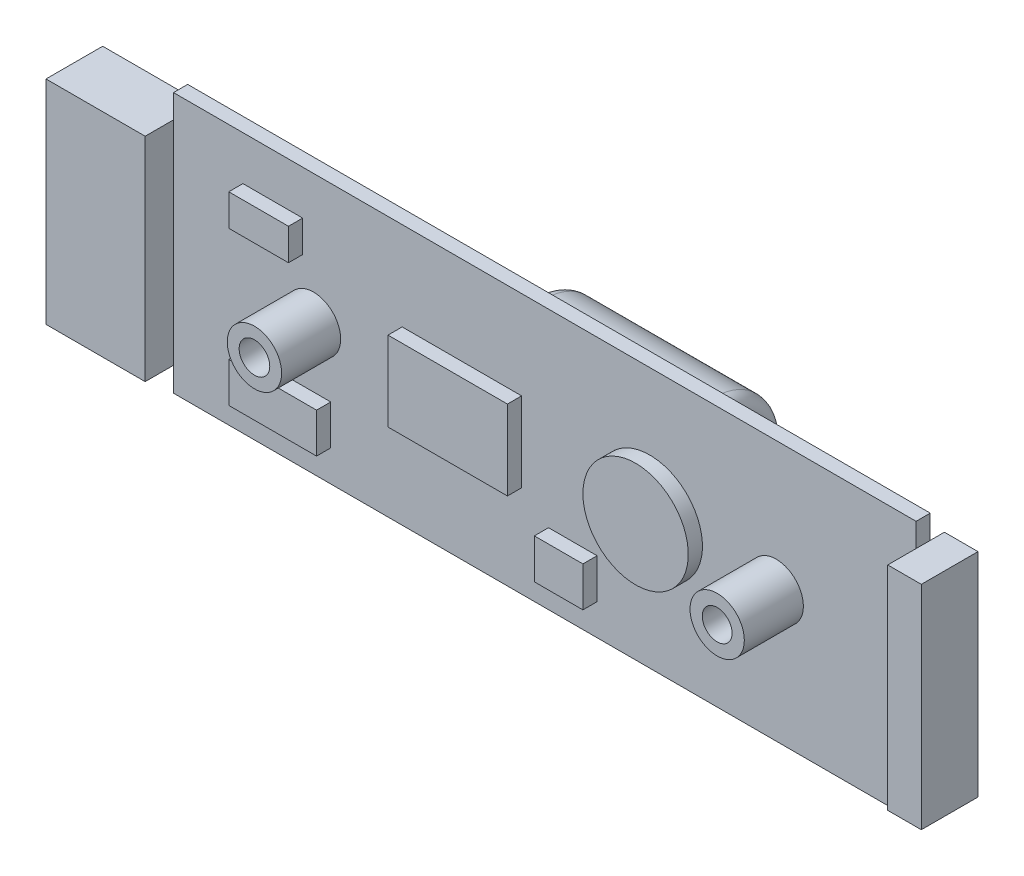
from build123d import *

# Parameters (mm, degrees)
SKETCH1_R           = 2.921
EXTRUDE3_DEPTH      = 6.35
EXTRUDE3_2_DEPTH    = 6.35
EXTRUDE4_START      = -1.524
SKETCH1_5_W         = 79.8576
SKETCH1_5_H         = 28
SKETCH1_5_R         = 2.921
EXTRUDE4_DEPTH      = 1.524
EXTRUDE5_DEPTH      = 3.048
EXTRUDE5_DEPTH_BACK = 3.048
SKETCH1_6_W         = 10.664080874
SKETCH1_6_H         = 22.86
EXTRUDE6_DEPTH      = 3.048
EXTRUDE6_DEPTH_BACK = 3.048
SKETCH1_7_W         = 3.611238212
SKETCH1_7_H         = 22.86
SKETCH4_R           = 2.989225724
SKETCH4_R_2         = 2.921
EXTRUDE7_DEPTH      = 2.032
FILLET1_R           = 1.27
FILLET2_R           = 1.27
SKETCH5_R           = 6.36772322
EXTRUDE8_DEPTH      = 20.828
FILLET3_R           = 1.27
FILLET4_R           = 1.27
SKETCH8_W           = 7.051771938
SKETCH8_H           = 4.911055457
SKETCH8_W_2         = 5.918451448
SKETCH8_H_2         = 5.162904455
SKETCH8_W_3         = 7.681394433
SKETCH8_H_3         = 3.525885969
SKETCH8_W_4         = 6.170300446
SKETCH8_H_4         = 4.155508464
EXTRUDE9_DEPTH      = 1.524
SKETCH9_R           = 5.666679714
SKETCH9_W           = 12.844298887
SKETCH9_H           = 8.562865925
SKETCH9_W_2         = 6.422149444
SKETCH9_H_2         = 3.399884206
SKETCH9_W_3         = 5.219653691
SKETCH9_H_3         = 4.281432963
SKETCH9_W_4         = 9.444337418
EXTRUDE10_DEPTH     = 1.524
SKETCH10_R          = 1.646766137
SKETCH10_R_2        = 1.604056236
CUT_EXTRUDE2_DEPTH  = 6.35
SKETCH12_W          = 4.495310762
SKETCH12_H          = 20.696232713
CUT_EXTRUDE3_DEPTH  = 7.62


with BuildPart() as part:
    # Sketch1 → Extrude3 (new body)
    with BuildSketch(Plane.XY):
        with Locations((-36.162959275, 27.336795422)):
            Circle(SKETCH1_R)
    extrude(amount=EXTRUDE3_DEPTH)


with BuildPart() as body_2:
    # Sketch1 → Extrude3 2 (new body)
    with BuildSketch(Plane.XY):
        with Locations((13.597734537, 27.336795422)):
            Circle(SKETCH1_R)
    extrude(amount=EXTRUDE3_2_DEPTH)


with BuildPart() as body_3:
    # Sketch1_5 → Extrude4 (new body)
    with BuildSketch(Plane.XY.offset(EXTRUDE4_START)):
        with Locations((-11.28908269, 27.306795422)):
            Rectangle(SKETCH1_5_W, SKETCH1_5_H)
        with Locations((-36.162959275, 27.336795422)):
            Circle(SKETCH1_5_R, mode=Mode.SUBTRACT)
        with Locations((13.597734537, 27.336795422)):
            Circle(SKETCH1_5_R, mode=Mode.SUBTRACT)
    extrude(amount=EXTRUDE4_DEPTH)

    # Sketch1_6 → Extrude5 (add, two sides: drawn at the far end of the back side and taken through both)
    with BuildSketch(Plane.XY.offset(-EXTRUDE5_DEPTH_BACK)):
        with Locations((-56.549923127, 27.336795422)):
            Rectangle(SKETCH1_6_W, SKETCH1_6_H)
    extrude(amount=EXTRUDE5_DEPTH + EXTRUDE5_DEPTH_BACK)

    # Sketch1_7 → Extrude6 (add, two sides: drawn at the far end of the back side and taken through both)
    with BuildSketch(Plane.XY.offset(-EXTRUDE6_DEPTH_BACK)):
        with Locations((30.445336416, 27.336795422)):
            Rectangle(SKETCH1_7_W, SKETCH1_7_H)
    extrude(amount=EXTRUDE6_DEPTH + EXTRUDE6_DEPTH_BACK)

    # Sketch4 → Extrude7 (add)
    with BuildSketch(Plane(origin=(0, 0, -1.524), x_dir=(-1, 0, 0), z_dir=(0, 0, -1))):
        with Locations(Location((36.162959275, 27.336795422, 0), (0, 0, 180))):
            Circle(SKETCH4_R)
        with Locations((-13.597734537, 27.336795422)):
            Circle(SKETCH4_R_2)
    extrude(amount=EXTRUDE7_DEPTH)


with BuildPart() as extrude7_piece_1:
    # of the separate pieces the step leaves, piece 1, a body of its own (extrude7_pieces)
    add(body_3.part.solids().sort_by_distance((28.63971731, 41.306795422, -1.524))[0])

    # Fillet1
    fillet1_edges = [extrude7_piece_1.edges().sort_by_distance(p)[0] for p in [
        (-39.152184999, 27.336795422, -3.556),
    ]]
    fillet(fillet1_edges, radius=FILLET1_R)

    # Sketch8 → Extrude9 (add)
    with BuildSketch(Plane(origin=(0, 0, -1.524), x_dir=(-1, 0, 0), z_dir=(0, 0, -1))):
        with Locations((-18.705923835, 34.736340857)):
            Rectangle(SKETCH8_W, SKETCH8_H)
        with Locations((-12.220812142, 19.247627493)):
            Rectangle(SKETCH8_W_2, SKETCH8_H_2)
        with Locations((28.704649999, 35.428925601)):
            Rectangle(SKETCH8_W_3, SKETCH8_H_3)
        with Locations((32.986082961, 18.743929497)):
            Rectangle(SKETCH8_W_4, SKETCH8_H_4)
    extrude(amount=EXTRUDE9_DEPTH)

    # Sketch9 → Extrude10 (add)
    with BuildSketch(Plane.XY):
        with Locations(Location((0, 27.49568217, 0), (0, 0, 180))):
            Circle(SKETCH9_R)
        with Locations((-20.204746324, 27.495682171)):
            Rectangle(SKETCH9_W, SKETCH9_H)
        with Locations((-40.541552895, 34.862303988)):
            Rectangle(SKETCH9_W_2, SKETCH9_H_2)
        with Locations((-8.276506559, 18.806891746)):
            Rectangle(SKETCH9_W_3, SKETCH9_H_3)
        with Locations((-39.030458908, 18.806891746)):
            Rectangle(SKETCH9_W_4, SKETCH9_H_3)
    extrude(amount=EXTRUDE10_DEPTH)

    # Sketch12 → Cut-Extrude3 (cut)
    with BuildSketch(Plane.ZY.offset(61.881963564)):
        with Locations((-0.048031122, 27.395811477)):
            Rectangle(SKETCH12_W, SKETCH12_H)
    extrude(amount=-CUT_EXTRUDE3_DEPTH, mode=Mode.SUBTRACT)


with BuildPart() as extrude7_piece_2:
    # of the separate pieces the step leaves, piece 2, a body of its own (extrude7_pieces)
    add(body_3.part.solids().sort_by_distance((10.676734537, 27.336795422, -3.556))[0])

    # Fillet2
    fillet2_edges = [extrude7_piece_2.edges().sort_by_distance(p)[0] for p in [
        (16.518734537, 27.336795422, -3.556),
    ]]
    fillet(fillet2_edges, radius=FILLET2_R)


with BuildPart() as body_5:
    # Sketch5 → Extrude8 (new body)
    with BuildSketch(Plane(origin=(0, 0, 0), x_dir=(0, 0, -1), z_dir=(1, 0, 0))):
        with Locations((8.1788, 27.432)):
            Circle(SKETCH5_R)
    extrude(amount=-EXTRUDE8_DEPTH)

    # Fillet3
    fillet3_edges = [body_5.edges().sort_by_distance(p)[0] for p in [
        (-20.828, 27.432, -1.81107678),
    ]]
    fillet(fillet3_edges, radius=FILLET3_R)

    # Fillet4
    fillet4_edges = [body_5.edges().sort_by_distance(p)[0] for p in [
        (0, 27.432, -1.81107678),
    ]]
    fillet(fillet4_edges, radius=FILLET4_R)


with BuildPart() as cut_extrude2_tool:
    # Sketch10 → Cut-Extrude2 (new body)
    with BuildSketch(Plane.XY.offset(6.35)):
        with Locations((-36.162959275, 27.336795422)):
            Circle(SKETCH10_R)
        with Locations((13.597734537, 27.336795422)):
            Circle(SKETCH10_R_2)
    extrude(amount=-CUT_EXTRUDE2_DEPTH)


with BuildPart() as part_1:
    add(part.part)

    # Cut-Extrude2: cut by cut_extrude2_tool
    add(cut_extrude2_tool.part, mode=Mode.SUBTRACT)


with BuildPart() as body_2_1:
    add(body_2.part)

    # Cut-Extrude2: cut by cut_extrude2_tool
    add(cut_extrude2_tool.part, mode=Mode.SUBTRACT)


solid = Compound([extrude7_piece_1.part, extrude7_piece_2.part, body_5.part, part_1.part, body_2_1.part])
